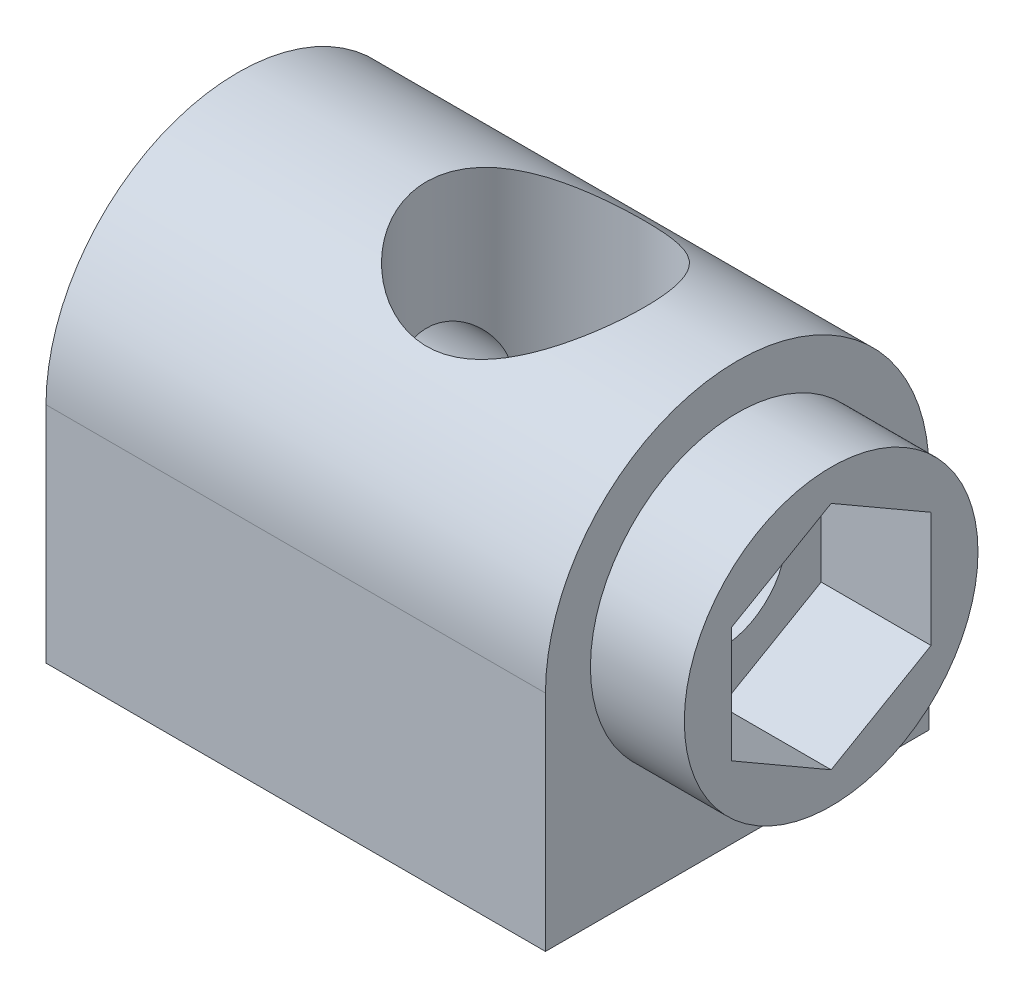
from build123d import *

# Parameters (mm, degrees)
BOSS_EXTRUDE1_DEPTH = 25
SKETCH2_R           = 7.35
BOSS_EXTRUDE2_DEPTH = 4.7
SKETCH3_R           = 4.9
CUT_EXTRUDE2_DEPTH  = 5
CUT_EXTRUDE3_DEPTH  = 5.5
SKETCH5_R           = 3.25
CUT_EXTRUDE4_DEPTH  = 34.688128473
SKETCH6_R           = 3.4
CUT_EXTRUDE5_DEPTH  = 38.508532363
CUT_EXTRUDE6_START  = -4
SKETCH7_R           = 5.45
CUT_EXTRUDE6_DEPTH  = 34.508532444
SKETCH8_W           = 8
SKETCH8_H           = 8
SKETCH8_W_2         = 2.8
BOSS_EXTRUDE3_DEPTH = 3


with BuildPart() as part:
    # Sketch1 → Boss-Extrude1 (new body)
    with BuildSketch(Plane(origin=(0, 0, 0), x_dir=(0, 0, -1), z_dir=(1, 0, 0))):
        with BuildLine():
            Line((-9.6, 0), (9.6, 0))
            Line((9.6, 0), (9.6, 11.2))
            ThreePointArc((9.6, 11.2), (0, 20.8), (-9.6, 11.2))
            Line((-9.6, 11.2), (-9.6, 0))
        make_face()
    extrude(amount=BOSS_EXTRUDE1_DEPTH)

    # Sketch2 → Boss-Extrude2 (add)
    with BuildSketch(Plane(origin=(25, 0, 0), x_dir=(0, 0, -1), z_dir=(1, 0, 0))):
        with Locations((0, 11.2)):
            Circle(SKETCH2_R)
    extrude(amount=BOSS_EXTRUDE2_DEPTH)

    # Sketch3 → Cut-Extrude2 (cut)
    with BuildSketch(Plane.ZY):
        with Locations((0, 11.2)):
            Circle(SKETCH3_R)
    extrude(amount=-CUT_EXTRUDE2_DEPTH, mode=Mode.SUBTRACT)

    # Sketch4 → Cut-Extrude3 (cut)
    with BuildSketch(Plane(origin=(29.7, 0, 0), x_dir=(0, 0, -1), z_dir=(1, 0, 0))):
        Polygon((0, 5.426497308), (5, 8.313248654), (5, 14.086751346), (0, 16.973502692), (-5, 14.086751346), (-5, 8.313248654), align=None)
    extrude(amount=-CUT_EXTRUDE3_DEPTH, mode=Mode.SUBTRACT)

    # Sketch5 → Cut-Extrude4 (cut, through all)
    with BuildSketch(Plane.ZY.offset(-5)):
        with Locations((0, 11.2)):
            Circle(SKETCH5_R)
    extrude(amount=-CUT_EXTRUDE4_DEPTH, mode=Mode.SUBTRACT)

    # Sketch6 → Cut-Extrude5 (cut, through all)
    with BuildSketch(Plane.XZ):
        with Locations(Location((14.9, 0, 0), (0, 0, 270))):
            Circle(SKETCH6_R)
    extrude(amount=-CUT_EXTRUDE5_DEPTH, mode=Mode.SUBTRACT)

    # Sketch7 → Cut-Extrude6 (cut, through all)
    with BuildSketch(Plane.XZ.offset(CUT_EXTRUDE6_START)):
        with Locations(Location((14.9, 0, 0), (0, 0, 270))):
            Circle(SKETCH7_R)
    extrude(amount=-CUT_EXTRUDE6_DEPTH, mode=Mode.SUBTRACT)

    # Sketch8 → Boss-Extrude3 (add)
    with BuildSketch(Plane.XZ):
        with Locations((7, 0)):
            Rectangle(SKETCH8_W, SKETCH8_H)
        with Locations((20.4, 0)):
            Rectangle(SKETCH8_W_2, SKETCH8_H)
    extrude(amount=BOSS_EXTRUDE3_DEPTH)


solid = part.part
